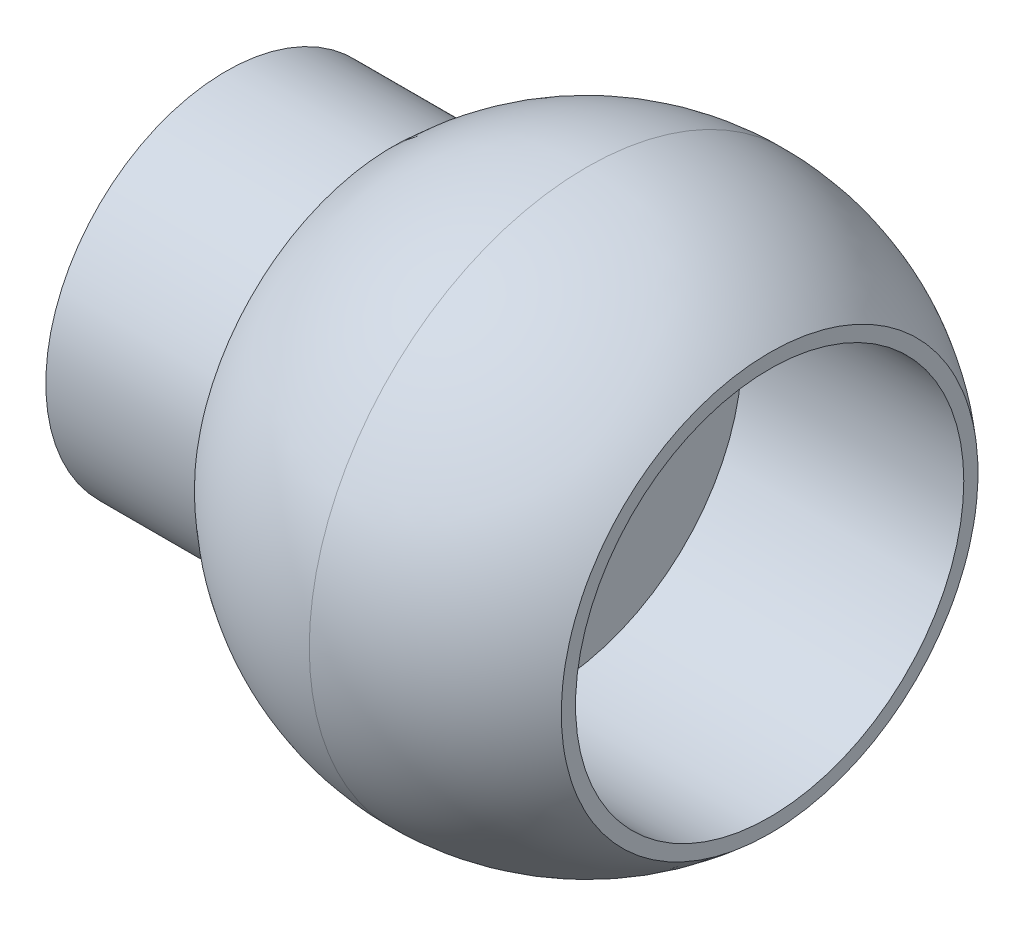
ISO-10303-21;
HEADER;
FILE_DESCRIPTION(('STEP AP214'),'2;1');
FILE_NAME('part.step','',(''),(''),'','','');
FILE_SCHEMA(('AUTOMOTIVE_DESIGN { 1 0 10303 214 1 1 1 1 }'));
ENDSEC;
DATA;
#1=APPLICATION_CONTEXT('core data for automotive mechanical design processes');
#2=APPLICATION_PROTOCOL_DEFINITION('international standard','automotive_design',2000,#1);
#3=PRODUCT_CONTEXT('',#1,'mechanical');
#4=PRODUCT('Part','Part','',(#3));
#5=PRODUCT_RELATED_PRODUCT_CATEGORY('part','',(#4));
#6=PRODUCT_DEFINITION_FORMATION('','',#4);
#7=PRODUCT_DEFINITION_CONTEXT('part definition',#1,'design');
#8=PRODUCT_DEFINITION('design','',#6,#7);
#9=PRODUCT_DEFINITION_SHAPE('','',#8);
#10=(LENGTH_UNIT() NAMED_UNIT(*) SI_UNIT(.MILLI.,.METRE.));
#11=(NAMED_UNIT(*) PLANE_ANGLE_UNIT() SI_UNIT($,.RADIAN.));
#12=(NAMED_UNIT(*) SI_UNIT($,.STERADIAN.) SOLID_ANGLE_UNIT());
#13=UNCERTAINTY_MEASURE_WITH_UNIT(LENGTH_MEASURE(1.E-05),#10,'distance_accuracy_value','');
#14=(GEOMETRIC_REPRESENTATION_CONTEXT(3) GLOBAL_UNCERTAINTY_ASSIGNED_CONTEXT((#13)) GLOBAL_UNIT_ASSIGNED_CONTEXT((#10,
#11,#12)) REPRESENTATION_CONTEXT('',''));
#15=CARTESIAN_POINT('',(0.,0.,0.));
#16=DIRECTION('',(0.,0.,1.));
#17=DIRECTION('',(1.,0.,0.));
#18=AXIS2_PLACEMENT_3D('',#15,#16,#17);
#19=CARTESIAN_POINT('',(-0.7,0.,0.));
#20=DIRECTION('',(1.,0.,0.));
#21=DIRECTION('',(0.,0.,-1.));
#22=AXIS2_PLACEMENT_3D('',#19,#20,#21);
#23=PLANE('',#22);
#24=CARTESIAN_POINT('',(-0.7,0.,0.));
#25=DIRECTION('',(1.,0.,0.));
#26=DIRECTION('',(0.,0.,-1.));
#27=AXIS2_PLACEMENT_3D('',#24,#25,#26);
#28=CIRCLE('',#27,2.);
#29=CARTESIAN_POINT('',(-0.7,0.,-2.));
#30=VERTEX_POINT('',#29);
#31=EDGE_CURVE('E22',#30,#30,#28,.F.);
#32=ORIENTED_EDGE('',*,*,#31,.T.);
#33=EDGE_LOOP('',(#32));
#34=FACE_BOUND('',#33,.T.);
#35=CARTESIAN_POINT('',(-0.7,0.,0.));
#36=DIRECTION('',(1.,0.,0.));
#37=DIRECTION('',(0.,0.,-1.));
#38=AXIS2_PLACEMENT_3D('',#35,#36,#37);
#39=CIRCLE('',#38,3.5);
#40=CARTESIAN_POINT('',(-0.7,0.,-3.5));
#41=VERTEX_POINT('',#40);
#42=EDGE_CURVE('E139',#41,#41,#39,.T.);
#43=ORIENTED_EDGE('',*,*,#42,.T.);
#44=EDGE_LOOP('',(#43));
#45=FACE_BOUND('',#44,.T.);
#46=ADVANCED_FACE('F16',(#34,#45),#23,.T.);
#47=CARTESIAN_POINT('',(-7.48,0.,0.));
#48=DIRECTION('',(1.,0.,0.));
#49=DIRECTION('',(0.,0.,-1.));
#50=AXIS2_PLACEMENT_3D('',#47,#48,#49);
#51=CYLINDRICAL_SURFACE('',#50,2.);
#52=ORIENTED_EDGE('',*,*,#31,.F.);
#53=EDGE_LOOP('',(#52));
#54=FACE_BOUND('',#53,.T.);
#55=CARTESIAN_POINT('',(-6.5,0.,0.));
#56=DIRECTION('',(1.,0.,0.));
#57=DIRECTION('',(0.,0.,-1.));
#58=AXIS2_PLACEMENT_3D('',#55,#56,#57);
#59=CIRCLE('',#58,2.);
#60=CARTESIAN_POINT('',(-6.5,0.,-2.));
#61=VERTEX_POINT('',#60);
#62=EDGE_CURVE('E141',#61,#61,#59,.F.);
#63=ORIENTED_EDGE('',*,*,#62,.T.);
#64=EDGE_LOOP('',(#63));
#65=FACE_BOUND('',#64,.T.);
#66=ADVANCED_FACE('F118',(#54,#65),#51,.F.);
#67=CARTESIAN_POINT('',(3.3,0.,0.));
#68=DIRECTION('',(1.,0.,0.));
#69=DIRECTION('',(0.,0.,-1.));
#70=AXIS2_PLACEMENT_3D('',#67,#68,#69);
#71=CYLINDRICAL_SURFACE('',#70,3.5);
#72=CARTESIAN_POINT('',(3.3,0.,0.));
#73=DIRECTION('',(1.,0.,0.));
#74=DIRECTION('',(0.,0.,-1.));
#75=AXIS2_PLACEMENT_3D('',#72,#73,#74);
#76=CIRCLE('',#75,3.5);
#77=CARTESIAN_POINT('',(3.3,0.,-3.5));
#78=VERTEX_POINT('',#77);
#79=EDGE_CURVE('E143',#78,#78,#76,.F.);
#80=ORIENTED_EDGE('',*,*,#79,.F.);
#81=EDGE_LOOP('',(#80));
#82=FACE_BOUND('',#81,.T.);
#83=ORIENTED_EDGE('',*,*,#42,.F.);
#84=EDGE_LOOP('',(#83));
#85=FACE_BOUND('',#84,.T.);
#86=ADVANCED_FACE('F111',(#82,#85),#71,.F.);
#87=CARTESIAN_POINT('',(-6.5,0.,0.));
#88=DIRECTION('',(1.,0.,0.));
#89=DIRECTION('',(0.,0.,-1.));
#90=AXIS2_PLACEMENT_3D('',#87,#88,#89);
#91=PLANE('',#90);
#92=ORIENTED_EDGE('',*,*,#62,.F.);
#93=EDGE_LOOP('',(#92));
#94=FACE_BOUND('',#93,.T.);
#95=CARTESIAN_POINT('',(-6.5,0.,0.));
#96=DIRECTION('',(1.,0.,0.));
#97=DIRECTION('',(0.,0.,-1.));
#98=AXIS2_PLACEMENT_3D('',#95,#96,#97);
#99=CIRCLE('',#98,3.25);
#100=CARTESIAN_POINT('',(-6.5,0.,-3.25));
#101=VERTEX_POINT('',#100);
#102=EDGE_CURVE('E51',#101,#101,#99,.T.);
#103=ORIENTED_EDGE('',*,*,#102,.F.);
#104=EDGE_LOOP('',(#103));
#105=FACE_BOUND('',#104,.T.);
#106=ADVANCED_FACE('F61',(#94,#105),#91,.F.);
#107=CARTESIAN_POINT('',(3.3,0.,0.));
#108=DIRECTION('',(1.,0.,0.));
#109=DIRECTION('',(0.,0.,-1.));
#110=AXIS2_PLACEMENT_3D('',#107,#108,#109);
#111=PLANE('',#110);
#112=ORIENTED_EDGE('',*,*,#79,.T.);
#113=EDGE_LOOP('',(#112));
#114=FACE_BOUND('',#113,.T.);
#115=CARTESIAN_POINT('',(3.3,-3.75632799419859,0.));
#116=CARTESIAN_POINT('',(3.3,-3.75632736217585,0.105465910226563));
#117=CARTESIAN_POINT('',(3.3,-3.751882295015,0.210951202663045));
#118=CARTESIAN_POINT('',(3.3,-3.73413092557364,0.421192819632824));
#119=CARTESIAN_POINT('',(3.3,-3.72082200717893,0.525948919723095));
#120=CARTESIAN_POINT('',(3.3,-3.68540281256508,0.734143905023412));
#121=CARTESIAN_POINT('',(3.3,-3.66327856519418,0.837580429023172));
#122=CARTESIAN_POINT('',(3.3,-3.61038121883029,1.04227950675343));
#123=CARTESIAN_POINT('',(3.29999999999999,-3.57960110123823,1.14354022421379));
#124=CARTESIAN_POINT('',(3.29999999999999,-3.4747024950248,1.44254039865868));
#125=CARTESIAN_POINT('',(3.3,-3.38793959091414,1.63600106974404));
#126=CARTESIAN_POINT('',(3.3,-3.18311997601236,2.00558871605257));
#127=CARTESIAN_POINT('',(3.29999999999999,-3.0650620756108,2.18171503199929));
#128=CARTESIAN_POINT('',(3.29999999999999,-2.86719169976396,2.42907713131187));
#129=CARTESIAN_POINT('',(3.3,-2.79771874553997,2.50877319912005));
#130=CARTESIAN_POINT('',(3.3,-2.65236084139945,2.66197457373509));
#131=CARTESIAN_POINT('',(3.3,-2.57648213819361,2.73548577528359));
#132=CARTESIAN_POINT('',(3.3,-2.41876539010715,2.87588679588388));
#133=CARTESIAN_POINT('',(3.3,-2.33692466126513,2.94277360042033));
#134=CARTESIAN_POINT('',(3.3,-2.16790689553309,3.06942172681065));
#135=CARTESIAN_POINT('',(3.3,-2.080728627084,3.12918139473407));
#136=CARTESIAN_POINT('',(3.3,-1.81213809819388,3.29706283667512));
#137=CARTESIAN_POINT('',(3.3,-1.62350343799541,3.39393515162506));
#138=CARTESIAN_POINT('',(3.3,-1.23274971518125,3.55457676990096));
#139=CARTESIAN_POINT('',(3.3,-1.03063079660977,3.61834642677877));
#140=CARTESIAN_POINT('',(3.3,-0.618529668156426,3.71106485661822));
#141=CARTESIAN_POINT('',(3.3,-0.408547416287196,3.74001344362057));
#142=CARTESIAN_POINT('',(3.3,0.0132964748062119,3.76223799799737));
#143=CARTESIAN_POINT('',(3.3,0.22515811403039,3.75551396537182));
#144=CARTESIAN_POINT('',(3.3,0.644720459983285,3.70661115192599));
#145=CARTESIAN_POINT('',(3.3,0.852421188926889,3.66443256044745));
#146=CARTESIAN_POINT('',(3.3,1.2578914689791,3.5457394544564));
#147=CARTESIAN_POINT('',(3.3,1.45566091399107,3.46922457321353));
#148=CARTESIAN_POINT('',(3.3,1.74040502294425,3.33049518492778));
#149=CARTESIAN_POINT('',(3.3,1.83338004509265,3.28022676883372));
#150=CARTESIAN_POINT('',(3.3,2.01476994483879,3.17203962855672));
#151=CARTESIAN_POINT('',(3.3,2.10318587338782,3.11412267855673));
#152=CARTESIAN_POINT('',(3.3,2.27478242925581,2.99107130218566));
#153=CARTESIAN_POINT('',(3.3,2.35796540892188,2.92594015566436));
#154=CARTESIAN_POINT('',(3.3,2.51861656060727,2.78886065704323));
#155=CARTESIAN_POINT('',(3.3,2.59607913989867,2.71690578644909));
#156=CARTESIAN_POINT('',(3.3,2.81884618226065,2.49170467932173));
#157=CARTESIAN_POINT('',(3.3,2.95475734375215,2.32895854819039));
#158=CARTESIAN_POINT('',(3.3,3.19727824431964,1.98293872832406));
#159=CARTESIAN_POINT('',(3.3,3.30388909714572,1.79966582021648));
#160=CARTESIAN_POINT('',(3.3,3.43962502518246,1.51334331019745));
#161=CARTESIAN_POINT('',(3.3,3.48087491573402,1.41587744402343));
#162=CARTESIAN_POINT('',(3.3,3.55498858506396,1.2178698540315));
#163=CARTESIAN_POINT('',(3.3,3.58785915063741,1.1173306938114));
#164=CARTESIAN_POINT('',(3.3,3.6449587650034,0.914009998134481));
#165=CARTESIAN_POINT('',(3.30000000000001,3.6692014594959,0.811232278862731));
#166=CARTESIAN_POINT('',(3.29999999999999,3.70894610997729,0.604019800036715));
#167=CARTESIAN_POINT('',(3.29999999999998,3.72445064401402,0.499585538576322));
#168=CARTESIAN_POINT('',(3.29999999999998,3.74245939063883,0.329157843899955));
#169=CARTESIAN_POINT('',(3.3,3.74765847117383,0.263437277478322));
#170=CARTESIAN_POINT('',(3.3,3.75459297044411,0.13181366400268));
#171=CARTESIAN_POINT('',(3.3,3.75632838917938,0.0659106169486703));
#172=CARTESIAN_POINT('',(3.3,3.75632736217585,-0.105465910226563));
#173=CARTESIAN_POINT('',(3.3,3.751882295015,-0.210951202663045));
#174=CARTESIAN_POINT('',(3.3,3.73413092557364,-0.421192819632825));
#175=CARTESIAN_POINT('',(3.3,3.72082200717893,-0.525948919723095));
#176=CARTESIAN_POINT('',(3.3,3.68540281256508,-0.734143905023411));
#177=CARTESIAN_POINT('',(3.3,3.66327856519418,-0.837580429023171));
#178=CARTESIAN_POINT('',(3.3,3.61038121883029,-1.04227950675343));
#179=CARTESIAN_POINT('',(3.29999999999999,3.57960110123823,-1.14354022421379));
#180=CARTESIAN_POINT('',(3.29999999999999,3.4747024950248,-1.44254039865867));
#181=CARTESIAN_POINT('',(3.3,3.38793959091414,-1.63600106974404));
#182=CARTESIAN_POINT('',(3.3,3.18311997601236,-2.00558871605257));
#183=CARTESIAN_POINT('',(3.29999999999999,3.06506207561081,-2.18171503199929));
#184=CARTESIAN_POINT('',(3.29999999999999,2.86719169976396,-2.42907713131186));
#185=CARTESIAN_POINT('',(3.3,2.79771874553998,-2.50877319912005));
#186=CARTESIAN_POINT('',(3.3,2.65236084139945,-2.66197457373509));
#187=CARTESIAN_POINT('',(3.3,2.57648213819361,-2.73548577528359));
#188=CARTESIAN_POINT('',(3.3,2.41876539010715,-2.87588679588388));
#189=CARTESIAN_POINT('',(3.3,2.33692466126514,-2.94277360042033));
#190=CARTESIAN_POINT('',(3.3,2.1679068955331,-3.06942172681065));
#191=CARTESIAN_POINT('',(3.3,2.080728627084,-3.12918139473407));
#192=CARTESIAN_POINT('',(3.3,1.81213809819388,-3.29706283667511));
#193=CARTESIAN_POINT('',(3.3,1.62350343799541,-3.39393515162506));
#194=CARTESIAN_POINT('',(3.3,1.23274971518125,-3.55457676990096));
#195=CARTESIAN_POINT('',(3.3,1.03063079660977,-3.61834642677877));
#196=CARTESIAN_POINT('',(3.3,0.618529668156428,-3.71106485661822));
#197=CARTESIAN_POINT('',(3.3,0.408547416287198,-3.74001344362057));
#198=CARTESIAN_POINT('',(3.3,-0.0132964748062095,-3.76223799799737));
#199=CARTESIAN_POINT('',(3.3,-0.225158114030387,-3.75551396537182));
#200=CARTESIAN_POINT('',(3.3,-0.644720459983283,-3.70661115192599));
#201=CARTESIAN_POINT('',(3.3,-0.852421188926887,-3.66443256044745));
#202=CARTESIAN_POINT('',(3.3,-1.2578914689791,-3.5457394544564));
#203=CARTESIAN_POINT('',(3.3,-1.45566091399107,-3.46922457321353));
#204=CARTESIAN_POINT('',(3.3,-1.74040502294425,-3.33049518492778));
#205=CARTESIAN_POINT('',(3.3,-1.83338004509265,-3.28022676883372));
#206=CARTESIAN_POINT('',(3.3,-2.01476994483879,-3.17203962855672));
#207=CARTESIAN_POINT('',(3.3,-2.10318587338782,-3.11412267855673));
#208=CARTESIAN_POINT('',(3.3,-2.27478242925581,-2.99107130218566));
#209=CARTESIAN_POINT('',(3.3,-2.35796540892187,-2.92594015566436));
#210=CARTESIAN_POINT('',(3.3,-2.51861656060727,-2.78886065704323));
#211=CARTESIAN_POINT('',(3.3,-2.59607913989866,-2.7169057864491));
#212=CARTESIAN_POINT('',(3.3,-2.81884618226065,-2.49170467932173));
#213=CARTESIAN_POINT('',(3.3,-2.95475734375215,-2.32895854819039));
#214=CARTESIAN_POINT('',(3.3,-3.19727824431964,-1.98293872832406));
#215=CARTESIAN_POINT('',(3.3,-3.30388909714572,-1.79966582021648));
#216=CARTESIAN_POINT('',(3.3,-3.43962502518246,-1.51334331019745));
#217=CARTESIAN_POINT('',(3.3,-3.48087491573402,-1.41587744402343));
#218=CARTESIAN_POINT('',(3.3,-3.55498858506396,-1.2178698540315));
#219=CARTESIAN_POINT('',(3.3,-3.58785915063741,-1.1173306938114));
#220=CARTESIAN_POINT('',(3.3,-3.6449587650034,-0.914009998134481));
#221=CARTESIAN_POINT('',(3.30000000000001,-3.6692014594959,-0.811232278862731));
#222=CARTESIAN_POINT('',(3.29999999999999,-3.70894610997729,-0.604019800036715));
#223=CARTESIAN_POINT('',(3.29999999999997,-3.72445064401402,-0.499585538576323));
#224=CARTESIAN_POINT('',(3.29999999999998,-3.74245939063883,-0.329157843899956));
#225=CARTESIAN_POINT('',(3.3,-3.74765847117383,-0.263437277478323));
#226=CARTESIAN_POINT('',(3.3,-3.75459297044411,-0.13181366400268));
#227=CARTESIAN_POINT('',(3.3,-3.75632838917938,-0.0659106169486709));
#228=CARTESIAN_POINT('',(3.3,-3.75632799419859,0.));
#229=B_SPLINE_CURVE_WITH_KNOTS('',3,(#115,#116,#117,#118,#119,#120,#121,#122,#123,#124,#125,
#126,#127,#128,#129,#130,#131,#132,#133,#134,#135,#136,#137,#138,#139,#140,#141,#142,#143,#144,
#145,#146,#147,#148,#149,#150,#151,#152,#153,#154,#155,#156,#157,#158,#159,#160,#161,#162,#163,
#164,#165,#166,#167,#168,#169,#170,#171,#172,#173,#174,#175,#176,#177,#178,#179,#180,#181,#182,
#183,#184,#185,#186,#187,#188,#189,#190,#191,#192,#193,#194,#195,#196,#197,#198,#199,#200,#201,
#202,#203,#204,#205,#206,#207,#208,#209,#210,#211,#212,#213,#214,#215,#216,#217,#218,#219,#220,
#221,#222,#223,#224,#225,#226,#227,#228),.UNSPECIFIED.,.T.,.F.,(4,2,2,2,2,2,2,2,2,2,2,2,2,2,2,2,
2,2,2,2,2,2,2,2,2,2,2,2,2,2,2,2,2,2,2,2,2,2,2,2,2,2,2,2,2,2,2,2,2,2,2,2,2,2,2,2,4),(0.,
0.316337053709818,0.632767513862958,0.949701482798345,1.26689318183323,1.89976456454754,
2.53266000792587,2.84952239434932,3.16607927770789,3.48277955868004,3.79955319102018,
4.43243998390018,5.06532001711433,5.69820343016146,6.3310868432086,6.96396687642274,
7.59685366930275,7.91362730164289,8.23032758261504,8.54688446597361,8.86374685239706,
9.49664229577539,10.1295136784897,10.4467053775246,10.76363934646,11.0800698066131,
11.3964068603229,11.5941007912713,11.7917947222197,12.1081317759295,12.4245622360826,
12.741496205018,13.0586879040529,13.6915592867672,14.3244547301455,14.641317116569,
14.9578739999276,15.2745742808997,15.5913479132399,16.2242347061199,16.857114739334,
17.4899981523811,18.1228815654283,18.7557615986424,19.3886483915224,19.7054220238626,
20.0221223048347,20.3386791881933,20.6555415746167,21.2884370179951,21.9213084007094,
22.2385000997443,22.5554340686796,22.8718645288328,23.1882015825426,23.385895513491,
23.5835894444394),.UNSPECIFIED.);
#230=CARTESIAN_POINT('',(3.3,-3.75632799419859,0.));
#231=VERTEX_POINT('',#230);
#232=EDGE_CURVE('E42',#231,#231,#229,.T.);
#233=ORIENTED_EDGE('',*,*,#232,.F.);
#234=EDGE_LOOP('',(#233));
#235=FACE_BOUND('',#234,.T.);
#236=ADVANCED_FACE('F56',(#114,#235),#111,.T.);
#237=CARTESIAN_POINT('',(-6.99,0.,0.));
#238=DIRECTION('',(1.,0.,0.));
#239=DIRECTION('',(0.,0.,-1.));
#240=AXIS2_PLACEMENT_3D('',#237,#238,#239);
#241=CYLINDRICAL_SURFACE('',#240,3.25);
#242=CARTESIAN_POINT('',(-3.5,0.,0.));
#243=DIRECTION('',(1.,0.,0.));
#244=DIRECTION('',(0.,0.,-1.));
#245=AXIS2_PLACEMENT_3D('',#242,#243,#244);
#246=CIRCLE('',#245,3.25);
#247=CARTESIAN_POINT('',(-3.5,0.,-3.25));
#248=VERTEX_POINT('',#247);
#249=EDGE_CURVE('E39',#248,#248,#246,.F.);
#250=ORIENTED_EDGE('',*,*,#249,.T.);
#251=EDGE_LOOP('',(#250));
#252=FACE_BOUND('',#251,.T.);
#253=ORIENTED_EDGE('',*,*,#102,.T.);
#254=EDGE_LOOP('',(#253));
#255=FACE_BOUND('',#254,.T.);
#256=ADVANCED_FACE('F60',(#252,#255),#241,.T.);
#257=CARTESIAN_POINT('',(0.,0.,0.));
#258=DIRECTION('',(0.,0.,-1.));
#259=DIRECTION('',(-1.,0.,0.));
#260=AXIS2_PLACEMENT_3D('',#257,#258,#259);
#261=SPHERICAL_SURFACE('',#260,5.);
#262=ORIENTED_EDGE('',*,*,#232,.T.);
#263=EDGE_LOOP('',(#262));
#264=FACE_BOUND('',#263,.T.);
#265=CARTESIAN_POINT('',(0.,0.,0.));
#266=DIRECTION('',(-1.,0.,0.));
#267=DIRECTION('',(0.,0.,1.));
#268=AXIS2_PLACEMENT_3D('',#265,#266,#267);
#269=CIRCLE('',#268,5.);
#270=CARTESIAN_POINT('',(0.,0.,5.));
#271=VERTEX_POINT('',#270);
#272=CARTESIAN_POINT('',(0.,0.,-5.));
#273=VERTEX_POINT('',#272);
#274=EDGE_CURVE('E28',#271,#273,#269,.T.);
#275=ORIENTED_EDGE('',*,*,#274,.F.);
#276=CARTESIAN_POINT('',(0.,0.,0.));
#277=DIRECTION('',(-1.,0.,0.));
#278=DIRECTION('',(0.,0.,-1.));
#279=AXIS2_PLACEMENT_3D('',#276,#277,#278);
#280=CIRCLE('',#279,5.);
#281=EDGE_CURVE('E34',#273,#271,#280,.T.);
#282=ORIENTED_EDGE('',*,*,#281,.F.);
#283=EDGE_LOOP('',(#275,#282));
#284=FACE_BOUND('',#283,.T.);
#285=ADVANCED_FACE('F36',(#264,#284),#261,.T.);
#286=CARTESIAN_POINT('',(-3.5,0.,0.));
#287=DIRECTION('',(1.,0.,0.));
#288=DIRECTION('',(0.,0.,-1.));
#289=AXIS2_PLACEMENT_3D('',#286,#287,#288);
#290=PLANE('',#289);
#291=ORIENTED_EDGE('',*,*,#249,.F.);
#292=EDGE_LOOP('',(#291));
#293=FACE_BOUND('',#292,.T.);
#294=CARTESIAN_POINT('',(-3.5,-3.57071421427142,0.));
#295=CARTESIAN_POINT('',(-3.49999999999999,-3.57071361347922,-0.100254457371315));
#296=CARTESIAN_POINT('',(-3.5,-3.56648819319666,-0.200527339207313));
#297=CARTESIAN_POINT('',(-3.5,-3.54961398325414,-0.400380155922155));
#298=CARTESIAN_POINT('',(-3.5,-3.53696270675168,-0.499959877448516));
#299=CARTESIAN_POINT('',(-3.5,-3.50329370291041,-0.697867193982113));
#300=CARTESIAN_POINT('',(-3.50000000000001,-3.48226269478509,-0.796192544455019));
#301=CARTESIAN_POINT('',(-3.49999999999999,-3.43197919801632,-0.990776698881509));
#302=CARTESIAN_POINT('',(-3.49999999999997,-3.4027200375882,-1.08703375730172));
#303=CARTESIAN_POINT('',(-3.49999999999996,-3.3030048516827,-1.37125924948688));
#304=CARTESIAN_POINT('',(-3.5,-3.2205292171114,-1.55516032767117));
#305=CARTESIAN_POINT('',(-3.5,-3.02583048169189,-1.90648530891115));
#306=CARTESIAN_POINT('',(-3.49999999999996,-2.9136062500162,-2.07390858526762));
#307=CARTESIAN_POINT('',(-3.49999999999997,-2.72551336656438,-2.30904762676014));
#308=CARTESIAN_POINT('',(-3.49999999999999,-2.65947332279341,-2.38480562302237));
#309=CARTESIAN_POINT('',(-3.50000000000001,-2.52129807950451,-2.53043676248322));
#310=CARTESIAN_POINT('',(-3.5,-2.44916881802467,-2.60031550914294));
#311=CARTESIAN_POINT('',(-3.5,-2.2992454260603,-2.73377880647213));
#312=CARTESIAN_POINT('',(-3.5,-2.22144874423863,-2.79736049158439));
#313=CARTESIAN_POINT('',(-3.5,-2.06078275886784,-2.91775047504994));
#314=CARTESIAN_POINT('',(-3.5,-1.97791228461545,-2.97455720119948));
#315=CARTESIAN_POINT('',(-3.5,-1.72259378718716,-3.13414301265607));
#316=CARTESIAN_POINT('',(-3.5,-1.54328024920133,-3.22622851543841));
#317=CARTESIAN_POINT('',(-3.5,-1.17183508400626,-3.37893224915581));
#318=CARTESIAN_POINT('',(-3.5,-0.979703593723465,-3.43955081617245));
#319=CARTESIAN_POINT('',(-3.5,-0.587965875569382,-3.52768769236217));
#320=CARTESIAN_POINT('',(-3.5,-0.388359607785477,-3.55520582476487));
#321=CARTESIAN_POINT('',(-3.5,0.0126394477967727,-3.57633218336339));
#322=CARTESIAN_POINT('',(-3.5,0.214032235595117,-3.5699404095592));
#323=CARTESIAN_POINT('',(-3.5,0.612862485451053,-3.52345406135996));
#324=CARTESIAN_POINT('',(-3.5,0.810299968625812,-3.48335966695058));
#325=CARTESIAN_POINT('',(-3.5,1.19573449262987,-3.37053161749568));
#326=CARTESIAN_POINT('',(-3.5,1.38373143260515,-3.29779761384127));
#327=CARTESIAN_POINT('',(-3.5,1.65440530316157,-3.16592334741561));
#328=CARTESIAN_POINT('',(-3.5,1.7427860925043,-3.11813887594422));
#329=CARTESIAN_POINT('',(-3.5,1.91521285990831,-3.01529765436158));
#330=CARTESIAN_POINT('',(-3.5,1.99925983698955,-2.96024259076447));
#331=CARTESIAN_POINT('',(-3.5,2.16237718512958,-2.84327162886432));
#332=CARTESIAN_POINT('',(-3.5,2.24144979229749,-2.78135884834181));
#333=CARTESIAN_POINT('',(-3.5,2.39416258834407,-2.65105294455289));
#334=CARTESIAN_POINT('',(-3.5,2.46779746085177,-2.58265362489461));
#335=CARTESIAN_POINT('',(-3.5,2.67955677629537,-2.36858052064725));
#336=CARTESIAN_POINT('',(-3.5,2.80875207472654,-2.2138762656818));
#337=CARTESIAN_POINT('',(-3.5,3.03928913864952,-1.88495453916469));
#338=CARTESIAN_POINT('',(-3.5,3.140631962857,-1.71073780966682));
#339=CARTESIAN_POINT('',(-3.5,3.26966068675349,-1.43856353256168));
#340=CARTESIAN_POINT('',(-3.5,3.3088722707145,-1.3459138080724));
#341=CARTESIAN_POINT('',(-3.5,3.37932371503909,-1.15769049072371));
#342=CARTESIAN_POINT('',(-3.49999999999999,3.41057002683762,-1.06211933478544));
#343=CARTESIAN_POINT('',(-3.50000000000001,3.46484814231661,-0.868845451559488));
#344=CARTESIAN_POINT('',(-3.50000000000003,3.48789291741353,-0.771146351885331));
#345=CARTESIAN_POINT('',(-3.49999999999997,3.52567364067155,-0.574172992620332));
#346=CARTESIAN_POINT('',(-3.4999999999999,3.54041203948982,-0.474899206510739));
#347=CARTESIAN_POINT('',(-3.49999999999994,3.55753090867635,-0.312892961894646));
#348=CARTESIAN_POINT('',(-3.49999999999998,3.56247308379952,-0.250419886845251));
#349=CARTESIAN_POINT('',(-3.50000000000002,3.56906492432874,-0.125300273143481));
#350=CARTESIAN_POINT('',(-3.5,3.57071458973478,-0.0626537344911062));
#351=CARTESIAN_POINT('',(-3.49999999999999,3.57071361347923,0.100254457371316));
#352=CARTESIAN_POINT('',(-3.5,3.56648819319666,0.200527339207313));
#353=CARTESIAN_POINT('',(-3.5,3.54961398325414,0.400380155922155));
#354=CARTESIAN_POINT('',(-3.5,3.53696270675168,0.499959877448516));
#355=CARTESIAN_POINT('',(-3.5,3.50329370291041,0.697867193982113));
#356=CARTESIAN_POINT('',(-3.50000000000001,3.48226269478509,0.796192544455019));
#357=CARTESIAN_POINT('',(-3.49999999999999,3.43197919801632,0.990776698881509));
#358=CARTESIAN_POINT('',(-3.49999999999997,3.4027200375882,1.08703375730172));
#359=CARTESIAN_POINT('',(-3.49999999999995,3.3030048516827,1.37125924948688));
#360=CARTESIAN_POINT('',(-3.5,3.2205292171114,1.55516032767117));
#361=CARTESIAN_POINT('',(-3.5,3.02583048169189,1.90648530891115));
#362=CARTESIAN_POINT('',(-3.49999999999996,2.9136062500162,2.07390858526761));
#363=CARTESIAN_POINT('',(-3.49999999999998,2.72551336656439,2.30904762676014));
#364=CARTESIAN_POINT('',(-3.49999999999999,2.65947332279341,2.38480562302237));
#365=CARTESIAN_POINT('',(-3.50000000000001,2.52129807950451,2.53043676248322));
#366=CARTESIAN_POINT('',(-3.5,2.44916881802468,2.60031550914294));
#367=CARTESIAN_POINT('',(-3.5,2.2992454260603,2.73377880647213));
#368=CARTESIAN_POINT('',(-3.5,2.22144874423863,2.79736049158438));
#369=CARTESIAN_POINT('',(-3.5,2.06078275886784,2.91775047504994));
#370=CARTESIAN_POINT('',(-3.5,1.97791228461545,2.97455720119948));
#371=CARTESIAN_POINT('',(-3.5,1.72259378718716,3.13414301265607));
#372=CARTESIAN_POINT('',(-3.5,1.54328024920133,3.22622851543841));
#373=CARTESIAN_POINT('',(-3.5,1.17183508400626,3.37893224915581));
#374=CARTESIAN_POINT('',(-3.5,0.979703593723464,3.43955081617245));
#375=CARTESIAN_POINT('',(-3.5,0.587965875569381,3.52768769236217));
#376=CARTESIAN_POINT('',(-3.5,0.388359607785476,3.55520582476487));
#377=CARTESIAN_POINT('',(-3.5,-0.0126394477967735,3.57633218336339));
#378=CARTESIAN_POINT('',(-3.5,-0.214032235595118,3.5699404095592));
#379=CARTESIAN_POINT('',(-3.5,-0.612862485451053,3.52345406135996));
#380=CARTESIAN_POINT('',(-3.5,-0.810299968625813,3.48335966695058));
#381=CARTESIAN_POINT('',(-3.5,-1.19573449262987,3.37053161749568));
#382=CARTESIAN_POINT('',(-3.5,-1.38373143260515,3.29779761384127));
#383=CARTESIAN_POINT('',(-3.5,-1.65440530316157,3.16592334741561));
#384=CARTESIAN_POINT('',(-3.5,-1.7427860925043,3.11813887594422));
#385=CARTESIAN_POINT('',(-3.5,-1.91521285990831,3.01529765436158));
#386=CARTESIAN_POINT('',(-3.5,-1.99925983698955,2.96024259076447));
#387=CARTESIAN_POINT('',(-3.5,-2.16237718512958,2.84327162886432));
#388=CARTESIAN_POINT('',(-3.5,-2.24144979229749,2.78135884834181));
#389=CARTESIAN_POINT('',(-3.5,-2.39416258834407,2.65105294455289));
#390=CARTESIAN_POINT('',(-3.5,-2.46779746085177,2.58265362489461));
#391=CARTESIAN_POINT('',(-3.5,-2.67955677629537,2.36858052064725));
#392=CARTESIAN_POINT('',(-3.5,-2.80875207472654,2.2138762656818));
#393=CARTESIAN_POINT('',(-3.5,-3.03928913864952,1.88495453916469));
#394=CARTESIAN_POINT('',(-3.49999999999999,-3.140631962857,1.71073780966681));
#395=CARTESIAN_POINT('',(-3.5,-3.26966068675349,1.43856353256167));
#396=CARTESIAN_POINT('',(-3.5,-3.3088722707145,1.3459138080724));
#397=CARTESIAN_POINT('',(-3.5,-3.37932371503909,1.15769049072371));
#398=CARTESIAN_POINT('',(-3.49999999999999,-3.41057002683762,1.06211933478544));
#399=CARTESIAN_POINT('',(-3.50000000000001,-3.46484814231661,0.868845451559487));
#400=CARTESIAN_POINT('',(-3.50000000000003,-3.48789291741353,0.771146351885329));
#401=CARTESIAN_POINT('',(-3.49999999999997,-3.52567364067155,0.574172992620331));
#402=CARTESIAN_POINT('',(-3.4999999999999,-3.54041203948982,0.474899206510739));
#403=CARTESIAN_POINT('',(-3.49999999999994,-3.55753090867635,0.312892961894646));
#404=CARTESIAN_POINT('',(-3.49999999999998,-3.56247308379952,0.250419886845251));
#405=CARTESIAN_POINT('',(-3.50000000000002,-3.56906492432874,0.125300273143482));
#406=CARTESIAN_POINT('',(-3.50000000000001,-3.57071458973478,0.0626537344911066));
#407=CARTESIAN_POINT('',(-3.5,-3.57071421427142,0.));
#408=B_SPLINE_CURVE_WITH_KNOTS('',3,(#294,#295,#296,#297,#298,#299,#300,#301,#302,#303,#304,
#305,#306,#307,#308,#309,#310,#311,#312,#313,#314,#315,#316,#317,#318,#319,#320,#321,#322,#323,
#324,#325,#326,#327,#328,#329,#330,#331,#332,#333,#334,#335,#336,#337,#338,#339,#340,#341,#342,
#343,#344,#345,#346,#347,#348,#349,#350,#351,#352,#353,#354,#355,#356,#357,#358,#359,#360,#361,
#362,#363,#364,#365,#366,#367,#368,#369,#370,#371,#372,#373,#374,#375,#376,#377,#378,#379,#380,
#381,#382,#383,#384,#385,#386,#387,#388,#389,#390,#391,#392,#393,#394,#395,#396,#397,#398,#399,
#400,#401,#402,#403,#404,#405,#406,#407),.UNSPECIFIED.,.T.,.F.,(4,2,2,2,2,2,2,2,2,2,2,2,2,2,2,2,
2,2,2,2,2,2,2,2,2,2,2,2,2,2,2,2,2,2,2,2,2,2,2,2,2,2,2,2,2,2,2,2,2,2,2,2,2,2,2,2,4),(0.,
0.300705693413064,0.601500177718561,0.902773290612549,1.20429139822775,1.80589031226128,
2.40751209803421,2.70871716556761,3.00963182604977,3.31068279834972,3.61180349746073,
4.21341706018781,4.81502419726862,5.41663454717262,6.01824489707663,6.61985203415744,
7.22146559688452,7.52258629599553,7.82363726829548,8.12455192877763,8.42575699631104,
9.02737878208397,9.6289776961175,9.93049580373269,10.2317689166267,10.5325634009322,
10.8332690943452,11.0211942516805,11.2091194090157,11.5098251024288,11.8106195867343,
12.1118926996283,12.4134108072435,13.015009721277,13.61663150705,13.9178365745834,
14.2187512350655,14.5198022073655,14.8209229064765,15.4225364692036,16.0241436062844,
16.6257539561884,17.2273643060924,17.8289714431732,18.4305850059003,18.7317057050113,
19.0327566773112,19.3336713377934,19.6348764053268,20.2364981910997,20.8380971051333,
21.1396152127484,21.4408883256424,21.7416828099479,22.042388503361,22.2303136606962,
22.4182388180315),.UNSPECIFIED.);
#409=CARTESIAN_POINT('',(-3.5,-3.57071421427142,0.));
#410=VERTEX_POINT('',#409);
#411=EDGE_CURVE('E11',#410,#410,#408,.T.);
#412=ORIENTED_EDGE('',*,*,#411,.F.);
#413=EDGE_LOOP('',(#412));
#414=FACE_BOUND('',#413,.T.);
#415=ADVANCED_FACE('F70',(#293,#414),#290,.F.);
#416=CARTESIAN_POINT('',(0.,0.,0.));
#417=DIRECTION('',(0.,0.,1.));
#418=DIRECTION('',(1.,0.,0.));
#419=AXIS2_PLACEMENT_3D('',#416,#417,#418);
#420=SPHERICAL_SURFACE('',#419,5.);
#421=ORIENTED_EDGE('',*,*,#411,.T.);
#422=EDGE_LOOP('',(#421));
#423=FACE_BOUND('',#422,.T.);
#424=ORIENTED_EDGE('',*,*,#274,.T.);
#425=ORIENTED_EDGE('',*,*,#281,.T.);
#426=EDGE_LOOP('',(#424,#425));
#427=FACE_BOUND('',#426,.T.);
#428=ADVANCED_FACE('F18',(#423,#427),#420,.T.);
#429=CLOSED_SHELL('',(#46,#66,#86,#106,#236,#256,#285,#415,#428));
#430=MANIFOLD_SOLID_BREP('B1',#429);
#431=ADVANCED_BREP_SHAPE_REPRESENTATION('',(#18,#430),#14);
#432=SHAPE_DEFINITION_REPRESENTATION(#9,#431);
ENDSEC;
END-ISO-10303-21;
